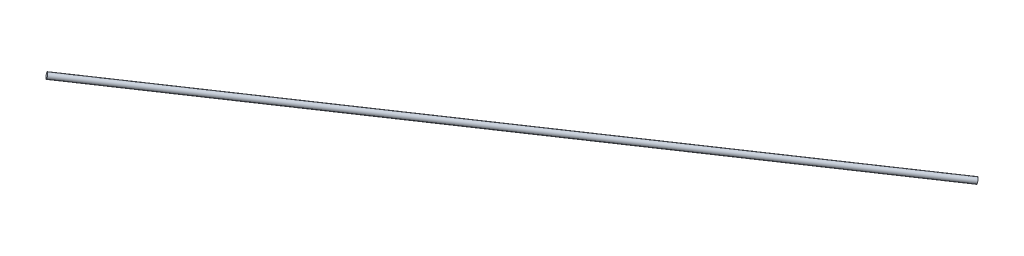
ISO-10303-21;
HEADER;
FILE_DESCRIPTION(('STEP AP214'),'2;1');
FILE_NAME('part.step','',(''),(''),'','','');
FILE_SCHEMA(('AUTOMOTIVE_DESIGN { 1 0 10303 214 1 1 1 1 }'));
ENDSEC;
DATA;
#1=APPLICATION_CONTEXT('core data for automotive mechanical design processes');
#2=APPLICATION_PROTOCOL_DEFINITION('international standard','automotive_design',2000,#1);
#3=PRODUCT_CONTEXT('',#1,'mechanical');
#4=PRODUCT('Part','Part','',(#3));
#5=PRODUCT_RELATED_PRODUCT_CATEGORY('part','',(#4));
#6=PRODUCT_DEFINITION_FORMATION('','',#4);
#7=PRODUCT_DEFINITION_CONTEXT('part definition',#1,'design');
#8=PRODUCT_DEFINITION('design','',#6,#7);
#9=PRODUCT_DEFINITION_SHAPE('','',#8);
#10=(LENGTH_UNIT() NAMED_UNIT(*) SI_UNIT(.MILLI.,.METRE.));
#11=(NAMED_UNIT(*) PLANE_ANGLE_UNIT() SI_UNIT($,.RADIAN.));
#12=(NAMED_UNIT(*) SI_UNIT($,.STERADIAN.) SOLID_ANGLE_UNIT());
#13=UNCERTAINTY_MEASURE_WITH_UNIT(LENGTH_MEASURE(1.E-05),#10,'distance_accuracy_value','');
#14=(GEOMETRIC_REPRESENTATION_CONTEXT(3) GLOBAL_UNCERTAINTY_ASSIGNED_CONTEXT((#13)) GLOBAL_UNIT_ASSIGNED_CONTEXT((#10,
#11,#12)) REPRESENTATION_CONTEXT('',''));
#15=CARTESIAN_POINT('',(0.,0.,0.));
#16=DIRECTION('',(0.,0.,1.));
#17=DIRECTION('',(1.,0.,0.));
#18=AXIS2_PLACEMENT_3D('',#15,#16,#17);
#19=CARTESIAN_POINT('',(-47.86320647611,17.77463235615,122.0384378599));
#20=DIRECTION('',(-0.642787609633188,0.185649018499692,0.743208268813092));
#21=DIRECTION('',(0.766044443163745,0.155778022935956,0.623625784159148));
#22=AXIS2_PLACEMENT_3D('',#19,#20,#21);
#23=PLANE('',#22);
#24=CARTESIAN_POINT('',(-47.5662831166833,18.2110640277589,122.18622354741));
#25=DIRECTION('',(-0.642787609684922,0.185649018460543,0.743208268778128));
#26=DIRECTION('',(0.756356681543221,0.,0.654159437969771));
#27=AXIS2_PLACEMENT_3D('',#24,#25,#26);
#28=CIRCLE('',#27,0.299999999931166);
#29=CARTESIAN_POINT('',(-47.3393761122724,18.2110640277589,122.382471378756));
#30=VERTEX_POINT('',#29);
#31=EDGE_CURVE('E18',#30,#30,#28,.T.);
#32=ORIENTED_EDGE('',*,*,#31,.T.);
#33=EDGE_LOOP('',(#32));
#34=FACE_BOUND('',#33,.T.);
#35=ADVANCED_FACE('F14',(#34),#23,.T.);
#36=CARTESIAN_POINT('',(-0.642787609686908,4.65868568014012,67.9320199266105));
#37=DIRECTION('',(-0.642787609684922,0.185649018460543,0.743208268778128));
#38=DIRECTION('',(0.756356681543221,0.,0.654159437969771));
#39=AXIS2_PLACEMENT_3D('',#36,#37,#38);
#40=CYLINDRICAL_SURFACE('',#39,0.299999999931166);
#41=ORIENTED_EDGE('',*,*,#31,.F.);
#42=EDGE_LOOP('',(#41));
#43=FACE_BOUND('',#42,.T.);
#44=CARTESIAN_POINT('',(-0.642787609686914,4.65868568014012,67.9320199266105));
#45=DIRECTION('',(-0.642787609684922,0.185649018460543,0.743208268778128));
#46=DIRECTION('',(0.756356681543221,0.,0.654159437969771));
#47=AXIS2_PLACEMENT_3D('',#44,#45,#46);
#48=CIRCLE('',#47,0.299999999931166);
#49=CARTESIAN_POINT('',(-0.41588060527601,4.65868568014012,68.1282677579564));
#50=VERTEX_POINT('',#49);
#51=EDGE_CURVE('E10',#50,#50,#48,.T.);
#52=ORIENTED_EDGE('',*,*,#51,.T.);
#53=EDGE_LOOP('',(#52));
#54=FACE_BOUND('',#53,.T.);
#55=ADVANCED_FACE('F28',(#43,#54),#40,.T.);
#56=CARTESIAN_POINT('',(-0.9397109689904,4.222254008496,67.78423423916));
#57=DIRECTION('',(-0.642787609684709,0.185649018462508,0.743208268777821));
#58=DIRECTION('',(0.766044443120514,0.155778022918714,0.623625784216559));
#59=AXIS2_PLACEMENT_3D('',#56,#57,#58);
#60=PLANE('',#59);
#61=ORIENTED_EDGE('',*,*,#51,.F.);
#62=EDGE_LOOP('',(#61));
#63=FACE_BOUND('',#62,.T.);
#64=ADVANCED_FACE('F16',(#63),#60,.F.);
#65=CLOSED_SHELL('',(#35,#55,#64));
#66=MANIFOLD_SOLID_BREP('B1',#65);
#67=ADVANCED_BREP_SHAPE_REPRESENTATION('',(#18,#66),#14);
#68=SHAPE_DEFINITION_REPRESENTATION(#9,#67);
ENDSEC;
END-ISO-10303-21;
